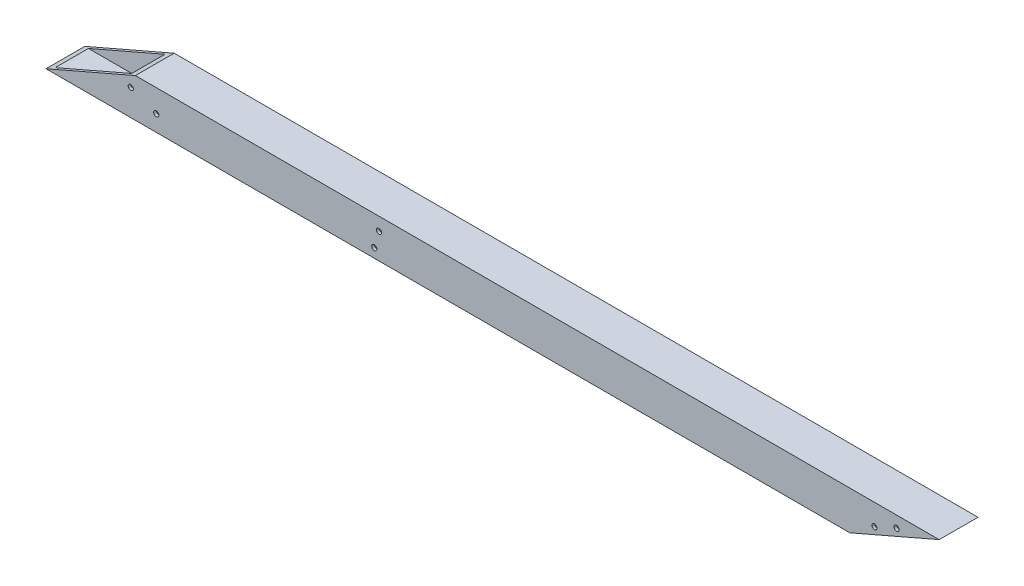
from build123d import *

# Parameters (mm, degrees)
SKETCH1_W          = 50.8
SKETCH1_H          = 50.8
SKETCH1_W_2        = 43.4848
SKETCH1_H_2        = 43.4848
EXTRUDE1_DEPTH     = 3048
SKETCH4_W          = 1984.826588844
SKETCH4_H          = 184.497034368
CUT_EXTRUDE1_DEPTH = 3049.846549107
SKETCH5_R          = 3.37312
CUT_EXTRUDE2_DEPTH = 3049.846549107
EXTRUDE2_DEPTH     = 3049.846549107
SKETCH7_R          = 3.37312
CUT_EXTRUDE3_DEPTH = 3049.846549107


with BuildPart() as part:
    # Sketch1 → Extrude1 (new body)
    with BuildSketch(Plane(origin=(0, 0, 0), x_dir=(0, 0, -1), z_dir=(1, 0, 0))):
        with Locations((25.4, 25.4)):
            Rectangle(SKETCH1_W, SKETCH1_H)
        with Locations((25.4, 25.4)):
            Rectangle(SKETCH1_W_2, SKETCH1_H_2, mode=Mode.SUBTRACT)
    extrude(amount=EXTRUDE1_DEPTH)

    # Sketch4 → Cut-Extrude1 (cut, through all)
    with BuildSketch(Plane(origin=(0, 0, -50.8), x_dir=(-1, 0, 0), z_dir=(0, 0, -1))):
        with Locations((-885.738147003, -41.448517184)):
            Rectangle(SKETCH4_W, SKETCH4_H)
    extrude(amount=-CUT_EXTRUDE1_DEPTH, mode=Mode.SUBTRACT)

    # Sketch5 → Cut-Extrude2 (cut, through all)
    with BuildSketch(Plane.XY):
        with Locations((2992.122548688, 35.855640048)):
            Circle(SKETCH5_R)
        with Locations((3030.742574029, 30.376067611)):
            Circle(SKETCH5_R)
        with Locations((2308.107258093, 12.060534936)):
            Circle(SKETCH5_R)
        with Locations((2314.327342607, 33.632317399)):
            Circle(SKETCH5_R)
        with Locations((2963.083265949, 23.018874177)):
            Circle(SKETCH5_R)
    extrude(amount=-CUT_EXTRUDE2_DEPTH, mode=Mode.SUBTRACT)

    # Sketch6 → Extrude2 (cut, through all)
    with BuildSketch(Plane(origin=(0, 0, -50.8), x_dir=(-1, 0, 0), z_dir=(0, 0, -1))):
        Polygon((-1878.151441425, 0), (-2090.021957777, 91.942074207), (-2045.985527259, 193.419241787), (-1862.256920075, 112.202321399), (-1832.531005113, 105.12733676), align=None)
        Polygon((-3048, 50.8), (-2907.602578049, -10.12603355), (-2983.250227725, -184.447819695), (-3123.647649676, -123.521786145), align=None)
    extrude(amount=-EXTRUDE2_DEPTH, mode=Mode.SUBTRACT)

    # Sketch7 → Cut-Extrude3 (cut, through all)
    with BuildSketch(Plane(origin=(0, 0, -50.8), x_dir=(-1, 0, 0), z_dir=(0, 0, -1))):
        with Locations((-2022.555194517, 21.131819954)):
            Circle(SKETCH7_R)
        with Locations((-1989.143156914, 34.321048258)):
            Circle(SKETCH7_R)
    extrude(amount=-CUT_EXTRUDE3_DEPTH, mode=Mode.SUBTRACT)


solid = part.part
